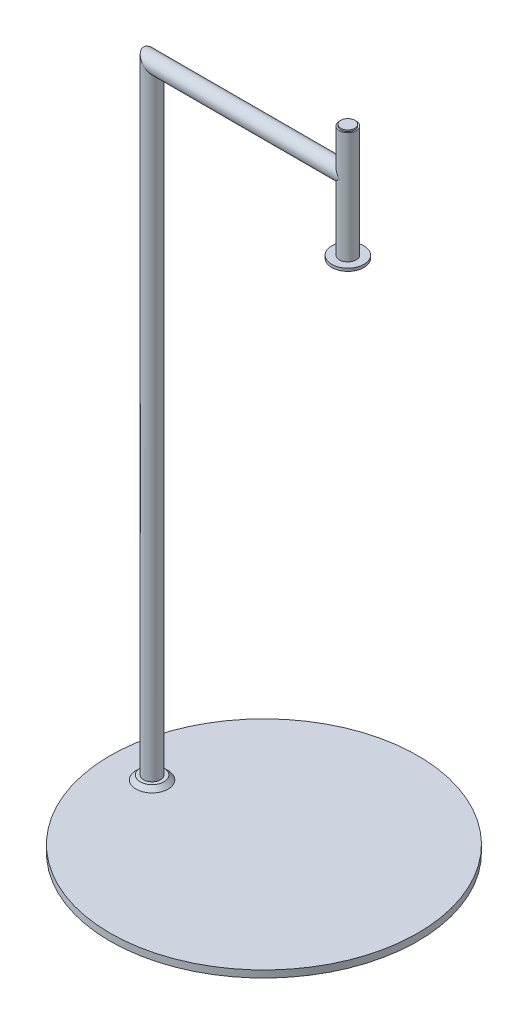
ISO-10303-21;
HEADER;
FILE_DESCRIPTION(('STEP AP214'),'2;1');
FILE_NAME('part.step','',(''),(''),'','','');
FILE_SCHEMA(('AUTOMOTIVE_DESIGN { 1 0 10303 214 1 1 1 1 }'));
ENDSEC;
DATA;
#1=APPLICATION_CONTEXT('core data for automotive mechanical design processes');
#2=APPLICATION_PROTOCOL_DEFINITION('international standard','automotive_design',2000,#1);
#3=PRODUCT_CONTEXT('',#1,'mechanical');
#4=PRODUCT('Part','Part','',(#3));
#5=PRODUCT_RELATED_PRODUCT_CATEGORY('part','',(#4));
#6=PRODUCT_DEFINITION_FORMATION('','',#4);
#7=PRODUCT_DEFINITION_CONTEXT('part definition',#1,'design');
#8=PRODUCT_DEFINITION('design','',#6,#7);
#9=PRODUCT_DEFINITION_SHAPE('','',#8);
#10=(LENGTH_UNIT() NAMED_UNIT(*) SI_UNIT(.MILLI.,.METRE.));
#11=(NAMED_UNIT(*) PLANE_ANGLE_UNIT() SI_UNIT($,.RADIAN.));
#12=(NAMED_UNIT(*) SI_UNIT($,.STERADIAN.) SOLID_ANGLE_UNIT());
#13=UNCERTAINTY_MEASURE_WITH_UNIT(LENGTH_MEASURE(1.E-05),#10,'distance_accuracy_value','');
#14=(GEOMETRIC_REPRESENTATION_CONTEXT(3) GLOBAL_UNCERTAINTY_ASSIGNED_CONTEXT((#13)) GLOBAL_UNIT_ASSIGNED_CONTEXT((#10,
#11,#12)) REPRESENTATION_CONTEXT('',''));
#15=CARTESIAN_POINT('',(0.,0.,0.));
#16=DIRECTION('',(0.,0.,1.));
#17=DIRECTION('',(1.,0.,0.));
#18=AXIS2_PLACEMENT_3D('',#15,#16,#17);
#19=CARTESIAN_POINT('',(60.,481.,0.));
#20=DIRECTION('',(0.,-1.,0.));
#21=DIRECTION('',(1.,0.,0.));
#22=AXIS2_PLACEMENT_3D('',#19,#20,#21);
#23=CYLINDRICAL_SURFACE('',#22,5.);
#24=CARTESIAN_POINT('',(60.,481.,0.));
#25=DIRECTION('',(0.,1.,0.));
#26=DIRECTION('',(-1.,0.,0.));
#27=AXIS2_PLACEMENT_3D('',#24,#25,#26);
#28=CIRCLE('',#27,5.);
#29=CARTESIAN_POINT('',(55.,481.,0.));
#30=VERTEX_POINT('',#29);
#31=EDGE_CURVE('E12',#30,#30,#28,.T.);
#32=ORIENTED_EDGE('',*,*,#31,.F.);
#33=EDGE_LOOP('',(#32));
#34=FACE_BOUND('',#33,.T.);
#35=CARTESIAN_POINT('',(60.,480.,0.));
#36=DIRECTION('',(0.,1.,0.));
#37=DIRECTION('',(-1.,0.,0.));
#38=AXIS2_PLACEMENT_3D('',#35,#36,#37);
#39=CIRCLE('',#38,5.);
#40=CARTESIAN_POINT('',(55.,480.,0.));
#41=VERTEX_POINT('',#40);
#42=EDGE_CURVE('E50',#41,#41,#39,.T.);
#43=ORIENTED_EDGE('',*,*,#42,.T.);
#44=EDGE_LOOP('',(#43));
#45=FACE_BOUND('',#44,.T.);
#46=ADVANCED_FACE('F47',(#34,#45),#23,.T.);
#47=CARTESIAN_POINT('',(60.,481.,0.));
#48=DIRECTION('',(0.,1.,0.));
#49=DIRECTION('',(-1.,0.,0.));
#50=AXIS2_PLACEMENT_3D('',#47,#48,#49);
#51=PLANE('',#50);
#52=ORIENTED_EDGE('',*,*,#31,.T.);
#53=EDGE_LOOP('',(#52));
#54=FACE_BOUND('',#53,.T.);
#55=ADVANCED_FACE('F62',(#54),#51,.T.);
#56=CARTESIAN_POINT('',(60.,480.,0.));
#57=DIRECTION('',(0.,1.,0.));
#58=DIRECTION('',(-1.,0.,0.));
#59=AXIS2_PLACEMENT_3D('',#56,#57,#58);
#60=PLANE('',#59);
#61=ORIENTED_EDGE('',*,*,#42,.F.);
#62=EDGE_LOOP('',(#61));
#63=FACE_BOUND('',#62,.T.);
#64=ADVANCED_FACE('F60',(#63),#60,.F.);
#65=CLOSED_SHELL('',(#46,#55,#64));
#66=MANIFOLD_SOLID_BREP('B2',#65);
#67=CARTESIAN_POINT('',(-93.3,450.,0.));
#68=DIRECTION('',(1.,0.,0.));
#69=DIRECTION('',(0.,0.,-1.));
#70=AXIS2_PLACEMENT_3D('',#67,#68,#69);
#71=CYLINDRICAL_SURFACE('',#70,6.);
#72=CARTESIAN_POINT('',(60.,450.,0.));
#73=DIRECTION('',(0.707106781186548,-0.707106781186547,0.));
#74=DIRECTION('',(0.707106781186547,0.707106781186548,0.));
#75=AXIS2_PLACEMENT_3D('',#72,#73,#74);
#76=ELLIPSE('',#75,8.48528137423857,6.);
#77=CARTESIAN_POINT('',(60.,450.,6.));
#78=VERTEX_POINT('',#77);
#79=CARTESIAN_POINT('',(60.,450.,-6.));
#80=VERTEX_POINT('',#79);
#81=EDGE_CURVE('E136',#78,#80,#76,.T.);
#82=ORIENTED_EDGE('',*,*,#81,.F.);
#83=CARTESIAN_POINT('',(60.,450.,0.));
#84=DIRECTION('',(0.707106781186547,0.707106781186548,0.));
#85=DIRECTION('',(0.707106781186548,-0.707106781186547,0.));
#86=AXIS2_PLACEMENT_3D('',#83,#84,#85);
#87=ELLIPSE('',#86,8.48528137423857,6.);
#88=EDGE_CURVE('E102',#80,#78,#87,.T.);
#89=ORIENTED_EDGE('',*,*,#88,.F.);
#90=EDGE_LOOP('',(#82,#89));
#91=FACE_BOUND('',#90,.T.);
#92=CARTESIAN_POINT('',(-80.,450.,0.));
#93=DIRECTION('',(0.707106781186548,0.707106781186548,0.));
#94=DIRECTION('',(-0.707106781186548,0.707106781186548,0.));
#95=AXIS2_PLACEMENT_3D('',#92,#93,#94);
#96=ELLIPSE('',#95,8.48528137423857,6.);
#97=CARTESIAN_POINT('',(-86.,456.,0.));
#98=VERTEX_POINT('',#97);
#99=EDGE_CURVE('E108',#98,#98,#96,.F.);
#100=ORIENTED_EDGE('',*,*,#99,.F.);
#101=EDGE_LOOP('',(#100));
#102=FACE_BOUND('',#101,.T.);
#103=ADVANCED_FACE('F88',(#91,#102),#71,.T.);
#104=CARTESIAN_POINT('',(-80.,5.,0.));
#105=DIRECTION('',(0.,1.,0.));
#106=DIRECTION('',(0.,0.,1.));
#107=AXIS2_PLACEMENT_3D('',#104,#105,#106);
#108=CYLINDRICAL_SURFACE('',#107,6.);
#109=CARTESIAN_POINT('',(-80.,8.,0.));
#110=DIRECTION('',(0.,1.,0.));
#111=DIRECTION('',(0.,0.,1.));
#112=AXIS2_PLACEMENT_3D('',#109,#110,#111);
#113=CIRCLE('',#112,6.);
#114=CARTESIAN_POINT('',(-80.,8.,6.));
#115=VERTEX_POINT('',#114);
#116=EDGE_CURVE('E138',#115,#115,#113,.F.);
#117=ORIENTED_EDGE('',*,*,#116,.F.);
#118=EDGE_LOOP('',(#117));
#119=FACE_BOUND('',#118,.T.);
#120=ORIENTED_EDGE('',*,*,#99,.T.);
#121=EDGE_LOOP('',(#120));
#122=FACE_BOUND('',#121,.T.);
#123=ADVANCED_FACE('F156',(#119,#122),#108,.T.);
#124=CARTESIAN_POINT('',(60.,480.,0.));
#125=DIRECTION('',(0.,-1.,0.));
#126=DIRECTION('',(1.,0.,0.));
#127=AXIS2_PLACEMENT_3D('',#124,#125,#126);
#128=PLANE('',#127);
#129=CARTESIAN_POINT('',(60.,480.,0.));
#130=DIRECTION('',(0.,-1.,0.));
#131=DIRECTION('',(1.,0.,0.));
#132=AXIS2_PLACEMENT_3D('',#129,#130,#131);
#133=CIRCLE('',#132,6.);
#134=CARTESIAN_POINT('',(66.,480.,0.));
#135=VERTEX_POINT('',#134);
#136=EDGE_CURVE('E115',#135,#135,#133,.T.);
#137=ORIENTED_EDGE('',*,*,#136,.F.);
#138=EDGE_LOOP('',(#137));
#139=FACE_BOUND('',#138,.T.);
#140=ADVANCED_FACE('F116',(#139),#128,.F.);
#141=CARTESIAN_POINT('',(60.,480.,0.));
#142=DIRECTION('',(0.,-1.,0.));
#143=DIRECTION('',(1.,0.,0.));
#144=AXIS2_PLACEMENT_3D('',#141,#142,#143);
#145=CYLINDRICAL_SURFACE('',#144,6.);
#146=ORIENTED_EDGE('',*,*,#88,.T.);
#147=ORIENTED_EDGE('',*,*,#81,.T.);
#148=EDGE_LOOP('',(#146,#147));
#149=FACE_BOUND('',#148,.T.);
#150=CARTESIAN_POINT('',(60.,400.,0.));
#151=DIRECTION('',(0.,-1.,0.));
#152=DIRECTION('',(1.,0.,0.));
#153=AXIS2_PLACEMENT_3D('',#150,#151,#152);
#154=CIRCLE('',#153,6.);
#155=CARTESIAN_POINT('',(66.,400.,0.));
#156=VERTEX_POINT('',#155);
#157=EDGE_CURVE('E118',#156,#156,#154,.T.);
#158=ORIENTED_EDGE('',*,*,#157,.F.);
#159=EDGE_LOOP('',(#158));
#160=FACE_BOUND('',#159,.T.);
#161=ORIENTED_EDGE('',*,*,#136,.T.);
#162=EDGE_LOOP('',(#161));
#163=FACE_BOUND('',#162,.T.);
#164=ADVANCED_FACE('F164',(#149,#160,#163),#145,.T.);
#165=CARTESIAN_POINT('',(60.,398.,0.));
#166=DIRECTION('',(0.,1.,0.));
#167=DIRECTION('',(-1.,0.,0.));
#168=AXIS2_PLACEMENT_3D('',#165,#166,#167);
#169=CYLINDRICAL_SURFACE('',#168,11.5);
#170=CARTESIAN_POINT('',(60.,398.,0.));
#171=DIRECTION('',(0.,-1.,0.));
#172=DIRECTION('',(1.,0.,0.));
#173=AXIS2_PLACEMENT_3D('',#170,#171,#172);
#174=CIRCLE('',#173,11.5);
#175=CARTESIAN_POINT('',(71.5,398.,0.));
#176=VERTEX_POINT('',#175);
#177=EDGE_CURVE('E119',#176,#176,#174,.T.);
#178=ORIENTED_EDGE('',*,*,#177,.F.);
#179=EDGE_LOOP('',(#178));
#180=FACE_BOUND('',#179,.T.);
#181=CARTESIAN_POINT('',(60.,400.,0.));
#182=DIRECTION('',(0.,-1.,0.));
#183=DIRECTION('',(1.,0.,0.));
#184=AXIS2_PLACEMENT_3D('',#181,#182,#183);
#185=CIRCLE('',#184,11.5);
#186=CARTESIAN_POINT('',(71.5,400.,0.));
#187=VERTEX_POINT('',#186);
#188=EDGE_CURVE('E124',#187,#187,#185,.T.);
#189=ORIENTED_EDGE('',*,*,#188,.T.);
#190=EDGE_LOOP('',(#189));
#191=FACE_BOUND('',#190,.T.);
#192=ADVANCED_FACE('F166',(#180,#191),#169,.T.);
#193=CARTESIAN_POINT('',(60.,398.,0.));
#194=DIRECTION('',(0.,-1.,0.));
#195=DIRECTION('',(1.,0.,0.));
#196=AXIS2_PLACEMENT_3D('',#193,#194,#195);
#197=PLANE('',#196);
#198=ORIENTED_EDGE('',*,*,#177,.T.);
#199=EDGE_LOOP('',(#198));
#200=FACE_BOUND('',#199,.T.);
#201=ADVANCED_FACE('F208',(#200),#197,.T.);
#202=CARTESIAN_POINT('',(60.,400.,0.));
#203=DIRECTION('',(0.,-1.,0.));
#204=DIRECTION('',(1.,0.,0.));
#205=AXIS2_PLACEMENT_3D('',#202,#203,#204);
#206=PLANE('',#205);
#207=ORIENTED_EDGE('',*,*,#157,.T.);
#208=EDGE_LOOP('',(#207));
#209=FACE_BOUND('',#208,.T.);
#210=ORIENTED_EDGE('',*,*,#188,.F.);
#211=EDGE_LOOP('',(#210));
#212=FACE_BOUND('',#211,.T.);
#213=ADVANCED_FACE('F204',(#209,#212),#206,.F.);
#214=CARTESIAN_POINT('',(-80.,8.,0.));
#215=DIRECTION('',(0.,1.,0.));
#216=DIRECTION('',(0.,0.,1.));
#217=AXIS2_PLACEMENT_3D('',#214,#215,#216);
#218=PLANE('',#217);
#219=CARTESIAN_POINT('',(-80.,8.,0.));
#220=DIRECTION('',(0.,1.,0.));
#221=DIRECTION('',(0.,0.,1.));
#222=AXIS2_PLACEMENT_3D('',#219,#220,#221);
#223=CIRCLE('',#222,8.49999999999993);
#224=CARTESIAN_POINT('',(-80.,8.,8.49999999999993));
#225=VERTEX_POINT('',#224);
#226=EDGE_CURVE('E96',#225,#225,#223,.T.);
#227=ORIENTED_EDGE('',*,*,#226,.T.);
#228=EDGE_LOOP('',(#227));
#229=FACE_BOUND('',#228,.T.);
#230=ORIENTED_EDGE('',*,*,#116,.T.);
#231=EDGE_LOOP('',(#230));
#232=FACE_BOUND('',#231,.T.);
#233=ADVANCED_FACE('F143',(#229,#232),#218,.T.);
#234=CARTESIAN_POINT('',(0.,0.,0.));
#235=DIRECTION('',(0.,1.,0.));
#236=DIRECTION('',(0.,0.,1.));
#237=AXIS2_PLACEMENT_3D('',#234,#235,#236);
#238=PLANE('',#237);
#239=CARTESIAN_POINT('',(0.,0.,0.));
#240=DIRECTION('',(0.,1.,0.));
#241=DIRECTION('',(0.,0.,1.));
#242=AXIS2_PLACEMENT_3D('',#239,#240,#241);
#243=CIRCLE('',#242,110.);
#244=CARTESIAN_POINT('',(0.,0.,110.));
#245=VERTEX_POINT('',#244);
#246=EDGE_CURVE('E129',#245,#245,#243,.T.);
#247=ORIENTED_EDGE('',*,*,#246,.F.);
#248=EDGE_LOOP('',(#247));
#249=FACE_BOUND('',#248,.T.);
#250=ADVANCED_FACE('F172',(#249),#238,.F.);
#251=CARTESIAN_POINT('',(0.,5.,0.));
#252=DIRECTION('',(0.,-1.,0.));
#253=DIRECTION('',(0.,0.,-1.));
#254=AXIS2_PLACEMENT_3D('',#251,#252,#253);
#255=CYLINDRICAL_SURFACE('',#254,110.);
#256=CARTESIAN_POINT('',(0.,5.,0.));
#257=DIRECTION('',(0.,1.,0.));
#258=DIRECTION('',(0.,0.,1.));
#259=AXIS2_PLACEMENT_3D('',#256,#257,#258);
#260=CIRCLE('',#259,110.);
#261=CARTESIAN_POINT('',(0.,5.,110.));
#262=VERTEX_POINT('',#261);
#263=EDGE_CURVE('E130',#262,#262,#260,.T.);
#264=ORIENTED_EDGE('',*,*,#263,.F.);
#265=EDGE_LOOP('',(#264));
#266=FACE_BOUND('',#265,.T.);
#267=ORIENTED_EDGE('',*,*,#246,.T.);
#268=EDGE_LOOP('',(#267));
#269=FACE_BOUND('',#268,.T.);
#270=ADVANCED_FACE('F152',(#266,#269),#255,.T.);
#271=CARTESIAN_POINT('',(0.,5.,0.));
#272=DIRECTION('',(0.,1.,0.));
#273=DIRECTION('',(0.,0.,1.));
#274=AXIS2_PLACEMENT_3D('',#271,#272,#273);
#275=PLANE('',#274);
#276=CARTESIAN_POINT('',(-80.,5.,0.));
#277=DIRECTION('',(0.,1.,0.));
#278=DIRECTION('',(0.,0.,1.));
#279=AXIS2_PLACEMENT_3D('',#276,#277,#278);
#280=CIRCLE('',#279,11.5);
#281=CARTESIAN_POINT('',(-80.,5.,11.5));
#282=VERTEX_POINT('',#281);
#283=EDGE_CURVE('E45',#282,#282,#280,.F.);
#284=ORIENTED_EDGE('',*,*,#283,.T.);
#285=EDGE_LOOP('',(#284));
#286=FACE_BOUND('',#285,.T.);
#287=ORIENTED_EDGE('',*,*,#263,.T.);
#288=EDGE_LOOP('',(#287));
#289=FACE_BOUND('',#288,.T.);
#290=ADVANCED_FACE('F147',(#286,#289),#275,.T.);
#291=CARTESIAN_POINT('',(-80.,8.,0.));
#292=DIRECTION('',(0.,-1.,0.));
#293=DIRECTION('',(0.,0.,-1.));
#294=AXIS2_PLACEMENT_3D('',#291,#292,#293);
#295=CONICAL_SURFACE('',#294,8.49999999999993,0.785398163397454);
#296=ORIENTED_EDGE('',*,*,#283,.F.);
#297=EDGE_LOOP('',(#296));
#298=FACE_BOUND('',#297,.T.);
#299=ORIENTED_EDGE('',*,*,#226,.F.);
#300=EDGE_LOOP('',(#299));
#301=FACE_BOUND('',#300,.T.);
#302=ADVANCED_FACE('F90',(#298,#301),#295,.T.);
#303=CLOSED_SHELL('',(#103,#123,#140,#164,#192,#201,#213,#233,#250,#270,#290,#302));
#304=MANIFOLD_SOLID_BREP('B7',#303);
#305=ADVANCED_BREP_SHAPE_REPRESENTATION('',(#18,#66,#304),#14);
#306=SHAPE_DEFINITION_REPRESENTATION(#9,#305);
ENDSEC;
END-ISO-10303-21;
